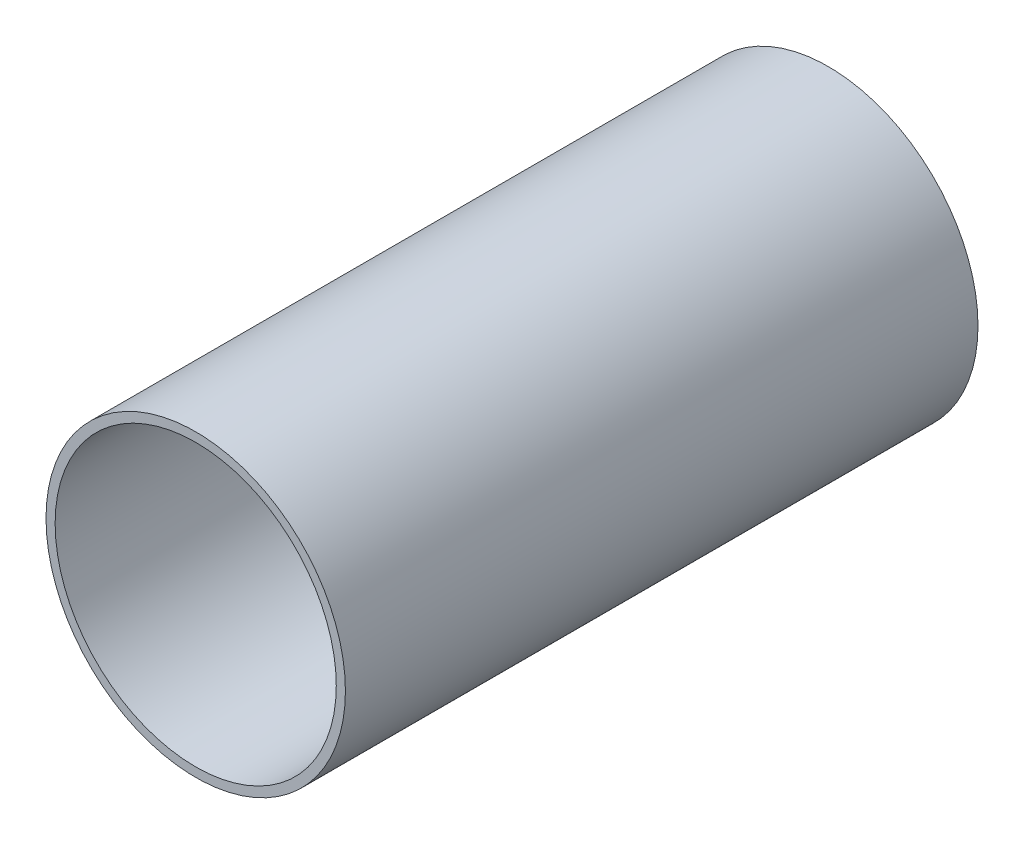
from build123d import *

# Parameters (mm, degrees)
SKETCH1_R      = 27.051
SKETCH1_R_2    = 25.4
EXTRUDE1_DEPTH = 114.3


with BuildPart() as part:
    # Sketch1 → Extrude1 (new body)
    with BuildSketch(Plane.XY):
        Circle(SKETCH1_R)
        Circle(SKETCH1_R_2, mode=Mode.SUBTRACT)
    extrude(amount=EXTRUDE1_DEPTH)


solid = part.part
